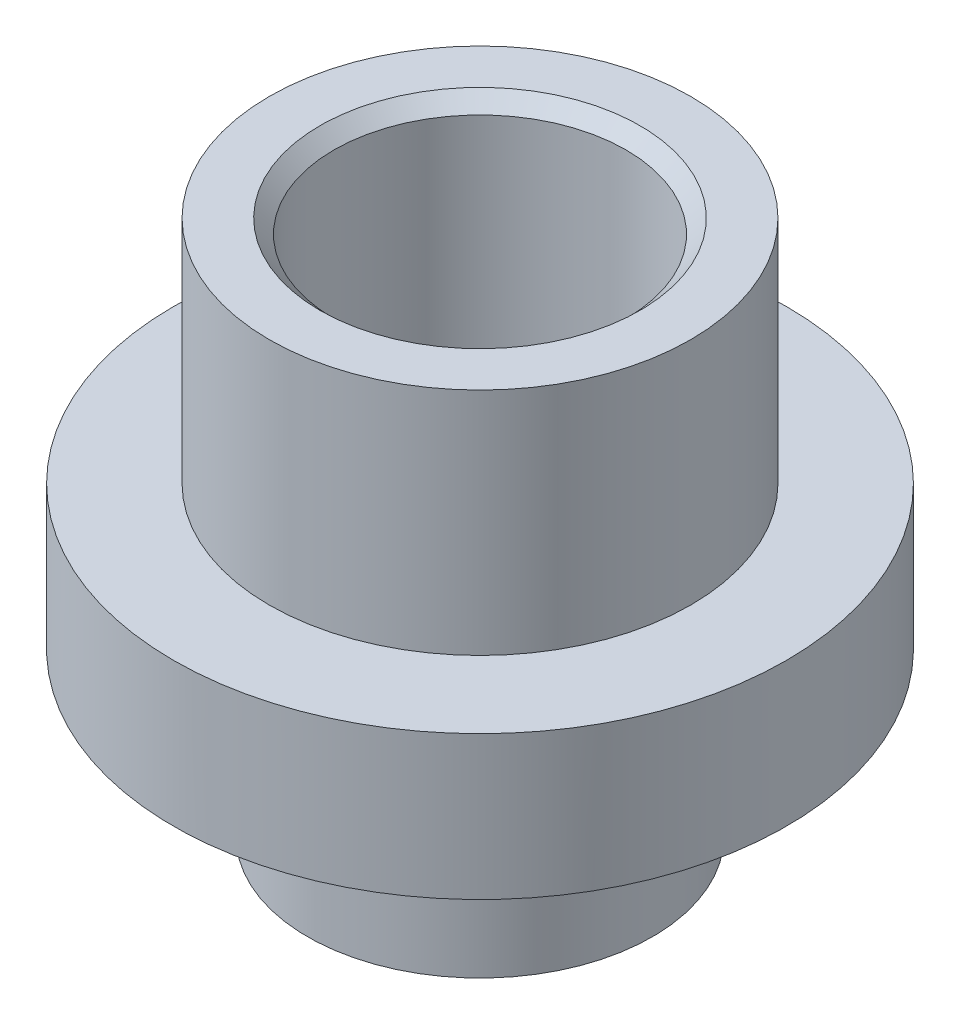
ISO-10303-21;
HEADER;
FILE_DESCRIPTION(('STEP AP214'),'2;1');
FILE_NAME('part.step','',(''),(''),'','','');
FILE_SCHEMA(('AUTOMOTIVE_DESIGN { 1 0 10303 214 1 1 1 1 }'));
ENDSEC;
DATA;
#1=APPLICATION_CONTEXT('core data for automotive mechanical design processes');
#2=APPLICATION_PROTOCOL_DEFINITION('international standard','automotive_design',2000,#1);
#3=PRODUCT_CONTEXT('',#1,'mechanical');
#4=PRODUCT('Part','Part','',(#3));
#5=PRODUCT_RELATED_PRODUCT_CATEGORY('part','',(#4));
#6=PRODUCT_DEFINITION_FORMATION('','',#4);
#7=PRODUCT_DEFINITION_CONTEXT('part definition',#1,'design');
#8=PRODUCT_DEFINITION('design','',#6,#7);
#9=PRODUCT_DEFINITION_SHAPE('','',#8);
#10=(LENGTH_UNIT() NAMED_UNIT(*) SI_UNIT(.MILLI.,.METRE.));
#11=(NAMED_UNIT(*) PLANE_ANGLE_UNIT() SI_UNIT($,.RADIAN.));
#12=(NAMED_UNIT(*) SI_UNIT($,.STERADIAN.) SOLID_ANGLE_UNIT());
#13=UNCERTAINTY_MEASURE_WITH_UNIT(LENGTH_MEASURE(1.E-05),#10,'distance_accuracy_value','');
#14=(GEOMETRIC_REPRESENTATION_CONTEXT(3) GLOBAL_UNCERTAINTY_ASSIGNED_CONTEXT((#13)) GLOBAL_UNIT_ASSIGNED_CONTEXT((#10,
#11,#12)) REPRESENTATION_CONTEXT('',''));
#15=CARTESIAN_POINT('',(0.,0.,0.));
#16=DIRECTION('',(0.,0.,1.));
#17=DIRECTION('',(1.,0.,0.));
#18=AXIS2_PLACEMENT_3D('',#15,#16,#17);
#19=CARTESIAN_POINT('',(0.,8.5,0.));
#20=DIRECTION('',(0.,-1.,0.));
#21=DIRECTION('',(0.,0.,-1.));
#22=AXIS2_PLACEMENT_3D('',#19,#20,#21);
#23=CYLINDRICAL_SURFACE('',#22,10.9);
#24=CARTESIAN_POINT('',(0.,8.2,0.));
#25=DIRECTION('',(0.,-1.,0.));
#26=DIRECTION('',(0.,0.,-1.));
#27=AXIS2_PLACEMENT_3D('',#24,#25,#26);
#28=CIRCLE('',#27,10.9);
#29=CARTESIAN_POINT('',(0.,8.2,-10.9));
#30=VERTEX_POINT('',#29);
#31=EDGE_CURVE('E46',#30,#30,#28,.T.);
#32=ORIENTED_EDGE('',*,*,#31,.T.);
#33=EDGE_LOOP('',(#32));
#34=FACE_BOUND('',#33,.T.);
#35=CARTESIAN_POINT('',(0.,7.,0.));
#36=DIRECTION('',(0.,-1.,0.));
#37=DIRECTION('',(0.,0.,-1.));
#38=AXIS2_PLACEMENT_3D('',#35,#36,#37);
#39=CIRCLE('',#38,10.9);
#40=CARTESIAN_POINT('',(0.,7.,-10.9));
#41=VERTEX_POINT('',#40);
#42=EDGE_CURVE('E53',#41,#41,#39,.F.);
#43=ORIENTED_EDGE('',*,*,#42,.T.);
#44=EDGE_LOOP('',(#43));
#45=FACE_BOUND('',#44,.T.);
#46=ADVANCED_FACE('F38',(#34,#45),#23,.T.);
#47=CARTESIAN_POINT('',(0.,28.,0.));
#48=DIRECTION('',(0.,-1.,0.));
#49=DIRECTION('',(0.,0.,-1.));
#50=AXIS2_PLACEMENT_3D('',#47,#48,#49);
#51=CYLINDRICAL_SURFACE('',#50,16.);
#52=CARTESIAN_POINT('',(0.,16.,0.));
#53=DIRECTION('',(0.,1.,0.));
#54=DIRECTION('',(0.,0.,1.));
#55=AXIS2_PLACEMENT_3D('',#52,#53,#54);
#56=CIRCLE('',#55,16.);
#57=CARTESIAN_POINT('',(0.,16.,16.));
#58=VERTEX_POINT('',#57);
#59=EDGE_CURVE('E50',#58,#58,#56,.T.);
#60=ORIENTED_EDGE('',*,*,#59,.F.);
#61=EDGE_LOOP('',(#60));
#62=FACE_BOUND('',#61,.T.);
#63=CARTESIAN_POINT('',(0.,8.5,0.));
#64=DIRECTION('',(0.,-1.,0.));
#65=DIRECTION('',(0.,0.,-1.));
#66=AXIS2_PLACEMENT_3D('',#63,#64,#65);
#67=CIRCLE('',#66,16.);
#68=CARTESIAN_POINT('',(0.,8.5,-16.));
#69=VERTEX_POINT('',#68);
#70=EDGE_CURVE('E56',#69,#69,#67,.T.);
#71=ORIENTED_EDGE('',*,*,#70,.F.);
#72=EDGE_LOOP('',(#71));
#73=FACE_BOUND('',#72,.T.);
#74=ADVANCED_FACE('F103',(#62,#73),#51,.T.);
#75=CARTESIAN_POINT('',(0.,16.,0.));
#76=DIRECTION('',(0.,1.,0.));
#77=DIRECTION('',(0.,0.,1.));
#78=AXIS2_PLACEMENT_3D('',#75,#76,#77);
#79=PLANE('',#78);
#80=CARTESIAN_POINT('',(0.,16.,0.));
#81=DIRECTION('',(0.,1.,0.));
#82=DIRECTION('',(0.,0.,1.));
#83=AXIS2_PLACEMENT_3D('',#80,#81,#82);
#84=CIRCLE('',#83,11.);
#85=CARTESIAN_POINT('',(0.,16.,11.));
#86=VERTEX_POINT('',#85);
#87=EDGE_CURVE('E63',#86,#86,#84,.T.);
#88=ORIENTED_EDGE('',*,*,#87,.F.);
#89=EDGE_LOOP('',(#88));
#90=FACE_BOUND('',#89,.T.);
#91=ORIENTED_EDGE('',*,*,#59,.T.);
#92=EDGE_LOOP('',(#91));
#93=FACE_BOUND('',#92,.T.);
#94=ADVANCED_FACE('F109',(#90,#93),#79,.T.);
#95=CARTESIAN_POINT('',(0.,16.,0.));
#96=DIRECTION('',(0.,1.,0.));
#97=DIRECTION('',(0.,0.,1.));
#98=AXIS2_PLACEMENT_3D('',#95,#96,#97);
#99=CYLINDRICAL_SURFACE('',#98,11.);
#100=ORIENTED_EDGE('',*,*,#87,.T.);
#101=EDGE_LOOP('',(#100));
#102=FACE_BOUND('',#101,.T.);
#103=CARTESIAN_POINT('',(0.,28.,0.));
#104=DIRECTION('',(0.,1.,0.));
#105=DIRECTION('',(0.,0.,1.));
#106=AXIS2_PLACEMENT_3D('',#103,#104,#105);
#107=CIRCLE('',#106,11.);
#108=CARTESIAN_POINT('',(0.,28.,11.));
#109=VERTEX_POINT('',#108);
#110=EDGE_CURVE('E60',#109,#109,#107,.T.);
#111=ORIENTED_EDGE('',*,*,#110,.F.);
#112=EDGE_LOOP('',(#111));
#113=FACE_BOUND('',#112,.T.);
#114=ADVANCED_FACE('F120',(#102,#113),#99,.T.);
#115=CARTESIAN_POINT('',(0.,28.,0.));
#116=DIRECTION('',(0.,1.,0.));
#117=DIRECTION('',(0.,0.,1.));
#118=AXIS2_PLACEMENT_3D('',#115,#116,#117);
#119=PLANE('',#118);
#120=CARTESIAN_POINT('',(0.,28.,0.));
#121=DIRECTION('',(0.,1.,0.));
#122=DIRECTION('',(0.,0.,1.));
#123=AXIS2_PLACEMENT_3D('',#120,#121,#122);
#124=CIRCLE('',#123,8.356);
#125=CARTESIAN_POINT('',(0.,28.,8.356));
#126=VERTEX_POINT('',#125);
#127=EDGE_CURVE('E79',#126,#126,#124,.T.);
#128=ORIENTED_EDGE('',*,*,#127,.F.);
#129=EDGE_LOOP('',(#128));
#130=FACE_BOUND('',#129,.T.);
#131=ORIENTED_EDGE('',*,*,#110,.T.);
#132=EDGE_LOOP('',(#131));
#133=FACE_BOUND('',#132,.T.);
#134=ADVANCED_FACE('F119',(#130,#133),#119,.T.);
#135=CARTESIAN_POINT('',(0.,8.5,0.));
#136=DIRECTION('',(0.,-1.,0.));
#137=DIRECTION('',(0.,0.,-1.));
#138=AXIS2_PLACEMENT_3D('',#135,#136,#137);
#139=PLANE('',#138);
#140=CARTESIAN_POINT('',(0.,8.5,0.));
#141=DIRECTION('',(0.,-1.,0.));
#142=DIRECTION('',(0.,0.,-1.));
#143=AXIS2_PLACEMENT_3D('',#140,#141,#142);
#144=CIRCLE('',#143,11.2);
#145=CARTESIAN_POINT('',(0.,8.5,-11.2));
#146=VERTEX_POINT('',#145);
#147=EDGE_CURVE('E11',#146,#146,#144,.F.);
#148=ORIENTED_EDGE('',*,*,#147,.T.);
#149=EDGE_LOOP('',(#148));
#150=FACE_BOUND('',#149,.T.);
#151=ORIENTED_EDGE('',*,*,#70,.T.);
#152=EDGE_LOOP('',(#151));
#153=FACE_BOUND('',#152,.T.);
#154=ADVANCED_FACE('F116',(#150,#153),#139,.T.);
#155=CARTESIAN_POINT('',(0.,7.,0.));
#156=DIRECTION('',(0.,-1.,0.));
#157=DIRECTION('',(0.,0.,-1.));
#158=AXIS2_PLACEMENT_3D('',#155,#156,#157);
#159=PLANE('',#158);
#160=ORIENTED_EDGE('',*,*,#42,.F.);
#161=EDGE_LOOP('',(#160));
#162=FACE_BOUND('',#161,.T.);
#163=CARTESIAN_POINT('',(0.,7.,0.));
#164=DIRECTION('',(0.,-1.,0.));
#165=DIRECTION('',(0.,0.,-1.));
#166=AXIS2_PLACEMENT_3D('',#163,#164,#165);
#167=CIRCLE('',#166,9.);
#168=CARTESIAN_POINT('',(0.,7.,-9.));
#169=VERTEX_POINT('',#168);
#170=EDGE_CURVE('E57',#169,#169,#167,.T.);
#171=ORIENTED_EDGE('',*,*,#170,.F.);
#172=EDGE_LOOP('',(#171));
#173=FACE_BOUND('',#172,.T.);
#174=ADVANCED_FACE('F114',(#162,#173),#159,.T.);
#175=CARTESIAN_POINT('',(0.,7.,0.));
#176=DIRECTION('',(0.,-1.,0.));
#177=DIRECTION('',(0.,0.,-1.));
#178=AXIS2_PLACEMENT_3D('',#175,#176,#177);
#179=CYLINDRICAL_SURFACE('',#178,9.);
#180=ORIENTED_EDGE('',*,*,#170,.T.);
#181=EDGE_LOOP('',(#180));
#182=FACE_BOUND('',#181,.T.);
#183=CARTESIAN_POINT('',(0.,0.,0.));
#184=DIRECTION('',(0.,-1.,0.));
#185=DIRECTION('',(0.,0.,-1.));
#186=AXIS2_PLACEMENT_3D('',#183,#184,#185);
#187=CIRCLE('',#186,9.);
#188=CARTESIAN_POINT('',(0.,0.,-9.));
#189=VERTEX_POINT('',#188);
#190=EDGE_CURVE('E68',#189,#189,#187,.T.);
#191=ORIENTED_EDGE('',*,*,#190,.F.);
#192=EDGE_LOOP('',(#191));
#193=FACE_BOUND('',#192,.T.);
#194=ADVANCED_FACE('F132',(#182,#193),#179,.T.);
#195=CARTESIAN_POINT('',(0.,0.,0.));
#196=DIRECTION('',(0.,1.,0.));
#197=DIRECTION('',(0.,0.,1.));
#198=AXIS2_PLACEMENT_3D('',#195,#196,#197);
#199=PLANE('',#198);
#200=CARTESIAN_POINT('',(0.,0.,0.));
#201=DIRECTION('',(0.,-1.,0.));
#202=DIRECTION('',(0.,0.,-1.));
#203=AXIS2_PLACEMENT_3D('',#200,#201,#202);
#204=CIRCLE('',#203,5.);
#205=CARTESIAN_POINT('',(0.,0.,-5.));
#206=VERTEX_POINT('',#205);
#207=EDGE_CURVE('E82',#206,#206,#204,.T.);
#208=ORIENTED_EDGE('',*,*,#207,.F.);
#209=EDGE_LOOP('',(#208));
#210=FACE_BOUND('',#209,.T.);
#211=ORIENTED_EDGE('',*,*,#190,.T.);
#212=EDGE_LOOP('',(#211));
#213=FACE_BOUND('',#212,.T.);
#214=ADVANCED_FACE('F130',(#210,#213),#199,.F.);
#215=CARTESIAN_POINT('',(0.,8.2,0.));
#216=DIRECTION('',(0.,-1.,0.));
#217=DIRECTION('',(0.,0.,-1.));
#218=AXIS2_PLACEMENT_3D('',#215,#216,#217);
#219=TOROIDAL_SURFACE('',#218,11.2,0.3);
#220=ORIENTED_EDGE('',*,*,#147,.F.);
#221=EDGE_LOOP('',(#220));
#222=FACE_BOUND('',#221,.T.);
#223=ORIENTED_EDGE('',*,*,#31,.F.);
#224=EDGE_LOOP('',(#223));
#225=FACE_BOUND('',#224,.T.);
#226=ADVANCED_FACE('F40',(#222,#225),#219,.F.);
#227=CARTESIAN_POINT('',(0.,10.99,0.));
#228=DIRECTION('',(0.,1.,0.));
#229=DIRECTION('',(0.,0.,1.));
#230=AXIS2_PLACEMENT_3D('',#227,#228,#229);
#231=CONICAL_SURFACE('',#230,7.625,1.0471975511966);
#232=CARTESIAN_POINT('',(0.,9.47445554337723,0.));
#233=DIRECTION('',(0.,1.,0.));
#234=DIRECTION('',(0.,0.,1.));
#235=AXIS2_PLACEMENT_3D('',#232,#233,#234);
#236=CIRCLE('',#235,5.);
#237=CARTESIAN_POINT('',(0.,9.47445554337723,5.));
#238=VERTEX_POINT('',#237);
#239=EDGE_CURVE('E42',#238,#238,#236,.F.);
#240=ORIENTED_EDGE('',*,*,#239,.T.);
#241=EDGE_LOOP('',(#240));
#242=FACE_BOUND('',#241,.T.);
#243=CARTESIAN_POINT('',(0.,10.99,0.));
#244=DIRECTION('',(0.,1.,0.));
#245=DIRECTION('',(0.,0.,1.));
#246=AXIS2_PLACEMENT_3D('',#243,#244,#245);
#247=CIRCLE('',#246,7.625);
#248=CARTESIAN_POINT('',(0.,10.99,7.625));
#249=VERTEX_POINT('',#248);
#250=EDGE_CURVE('E71',#249,#249,#247,.T.);
#251=ORIENTED_EDGE('',*,*,#250,.T.);
#252=EDGE_LOOP('',(#251));
#253=FACE_BOUND('',#252,.T.);
#254=ADVANCED_FACE('F89',(#242,#253),#231,.F.);
#255=CARTESIAN_POINT('',(0.,28.,0.));
#256=DIRECTION('',(0.,1.,0.));
#257=DIRECTION('',(0.,0.,1.));
#258=AXIS2_PLACEMENT_3D('',#255,#256,#257);
#259=CYLINDRICAL_SURFACE('',#258,7.625);
#260=ORIENTED_EDGE('',*,*,#250,.F.);
#261=EDGE_LOOP('',(#260));
#262=FACE_BOUND('',#261,.T.);
#263=CARTESIAN_POINT('',(0.,27.269,0.));
#264=DIRECTION('',(0.,1.,0.));
#265=DIRECTION('',(0.,0.,1.));
#266=AXIS2_PLACEMENT_3D('',#263,#264,#265);
#267=CIRCLE('',#266,7.625);
#268=CARTESIAN_POINT('',(0.,27.269,7.625));
#269=VERTEX_POINT('',#268);
#270=EDGE_CURVE('E76',#269,#269,#267,.T.);
#271=ORIENTED_EDGE('',*,*,#270,.T.);
#272=EDGE_LOOP('',(#271));
#273=FACE_BOUND('',#272,.T.);
#274=ADVANCED_FACE('F99',(#262,#273),#259,.F.);
#275=CARTESIAN_POINT('',(0.,28.,0.));
#276=DIRECTION('',(0.,1.,0.));
#277=DIRECTION('',(0.,0.,1.));
#278=AXIS2_PLACEMENT_3D('',#275,#276,#277);
#279=CONICAL_SURFACE('',#278,8.356,0.785398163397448);
#280=ORIENTED_EDGE('',*,*,#270,.F.);
#281=EDGE_LOOP('',(#280));
#282=FACE_BOUND('',#281,.T.);
#283=ORIENTED_EDGE('',*,*,#127,.T.);
#284=EDGE_LOOP('',(#283));
#285=FACE_BOUND('',#284,.T.);
#286=ADVANCED_FACE('F94',(#282,#285),#279,.F.);
#287=CARTESIAN_POINT('',(0.,28.,0.));
#288=DIRECTION('',(0.,-1.,0.));
#289=DIRECTION('',(0.,0.,-1.));
#290=AXIS2_PLACEMENT_3D('',#287,#288,#289);
#291=CYLINDRICAL_SURFACE('',#290,5.);
#292=ORIENTED_EDGE('',*,*,#207,.T.);
#293=EDGE_LOOP('',(#292));
#294=FACE_BOUND('',#293,.T.);
#295=ORIENTED_EDGE('',*,*,#239,.F.);
#296=EDGE_LOOP('',(#295));
#297=FACE_BOUND('',#296,.T.);
#298=ADVANCED_FACE('F92',(#294,#297),#291,.F.);
#299=CLOSED_SHELL('',(#46,#74,#94,#114,#134,#154,#174,#194,#214,#226,#254,#274,#286,#298));
#300=MANIFOLD_SOLID_BREP('B2',#299);
#301=ADVANCED_BREP_SHAPE_REPRESENTATION('',(#18,#300),#14);
#302=SHAPE_DEFINITION_REPRESENTATION(#9,#301);
ENDSEC;
END-ISO-10303-21;
